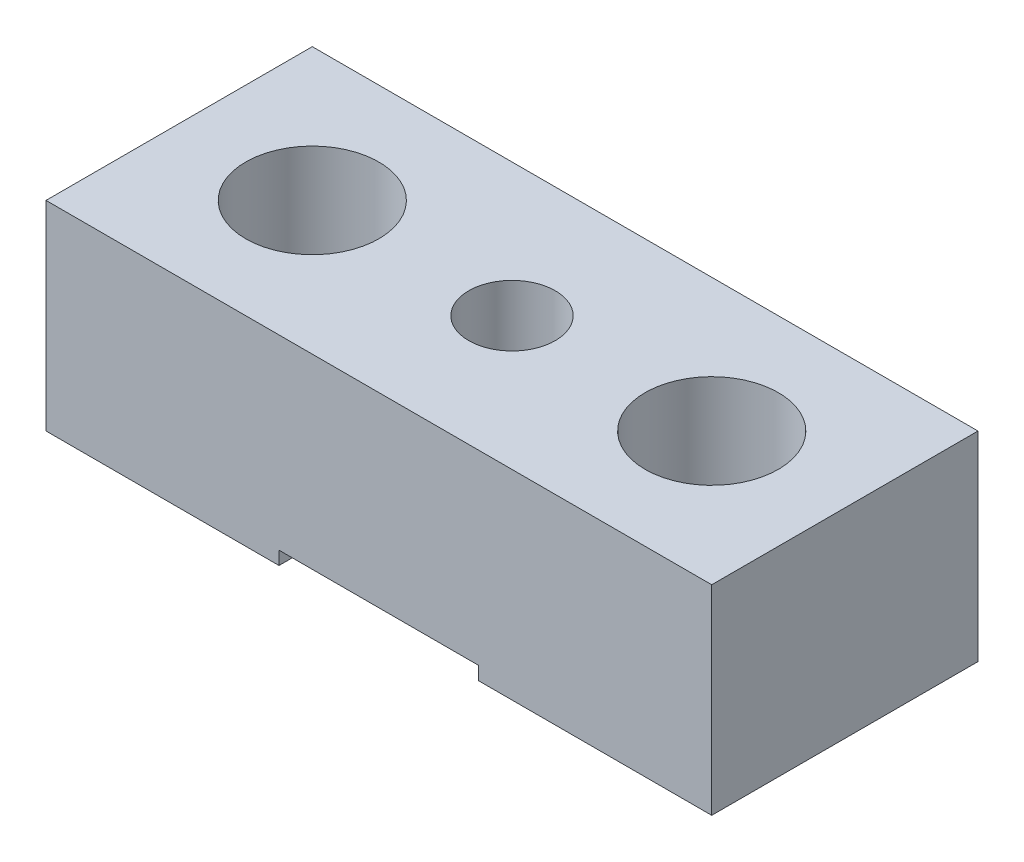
from build123d import *

# Parameters (mm, degrees)
EXTRUSION1_DEPTH        = 10
ENL_V_MAT_EXTRU_1_REACH = 55.151
ESQUISSE2_R             = 5
ESQUISSE2_R_2           = 3.25


with BuildPart() as part:
    # Esquisse1 → Extrusion1 (new, symmetric)
    with BuildSketch(Plane.XY):
        Polygon((0, 0), (50, 0), (50, -15), (32.5, -15), (32.5, -14), (17.5, -14), (17.5, -15), (0, -15), align=None)
    extrude(amount=EXTRUSION1_DEPTH, both=True)

    # Esquisse2 → Enl_v. mat.-Extru.1 (cut, up to next)
    with BuildSketch(Plane(origin=(0, 0, 0), x_dir=(-1, 0, 0), z_dir=(0, 1, 0)), mode=Mode.PRIVATE) as enl_v_mat_extru_1_sk1:
        with Locations(Location((-10, 0, 0), (0, 0, 90))):
            Circle(ESQUISSE2_R)
    enl_v_mat_extru_1_tool1 = extrude(enl_v_mat_extru_1_sk1.sketch, amount=-ENL_V_MAT_EXTRU_1_REACH, mode=Mode.PRIVATE) & part.part
    # Esquisse2 → Enl_v. mat.-Extru.1 (cut, up to next)
    with BuildSketch(Plane(origin=(0, 0, 0), x_dir=(-1, 0, 0), z_dir=(0, 1, 0)), mode=Mode.PRIVATE) as enl_v_mat_extru_1_sk2:
        with Locations(Location((-25, 0, 0), (0, 0, 90))):
            Circle(ESQUISSE2_R_2)
    enl_v_mat_extru_1_tool2 = extrude(enl_v_mat_extru_1_sk2.sketch, amount=-ENL_V_MAT_EXTRU_1_REACH, mode=Mode.PRIVATE) & part.part
    # Esquisse2 → Enl_v. mat.-Extru.1 (cut, up to next)
    with BuildSketch(Plane(origin=(0, 0, 0), x_dir=(-1, 0, 0), z_dir=(0, 1, 0)), mode=Mode.PRIVATE) as enl_v_mat_extru_1_sk3:
        with Locations(Location((-40, 0, 0), (0, 0, 90))):
            Circle(ESQUISSE2_R)
    enl_v_mat_extru_1_tool3 = extrude(enl_v_mat_extru_1_sk3.sketch, amount=-ENL_V_MAT_EXTRU_1_REACH, mode=Mode.PRIVATE) & part.part
    add(enl_v_mat_extru_1_tool1.solids().sort_by_distance((10, 0, 0))[0], mode=Mode.SUBTRACT)
    add(enl_v_mat_extru_1_tool2.solids().sort_by_distance((25, 0, 0))[0], mode=Mode.SUBTRACT)
    add(enl_v_mat_extru_1_tool3.solids().sort_by_distance((40, 0, 0))[0], mode=Mode.SUBTRACT)


solid = part.part
